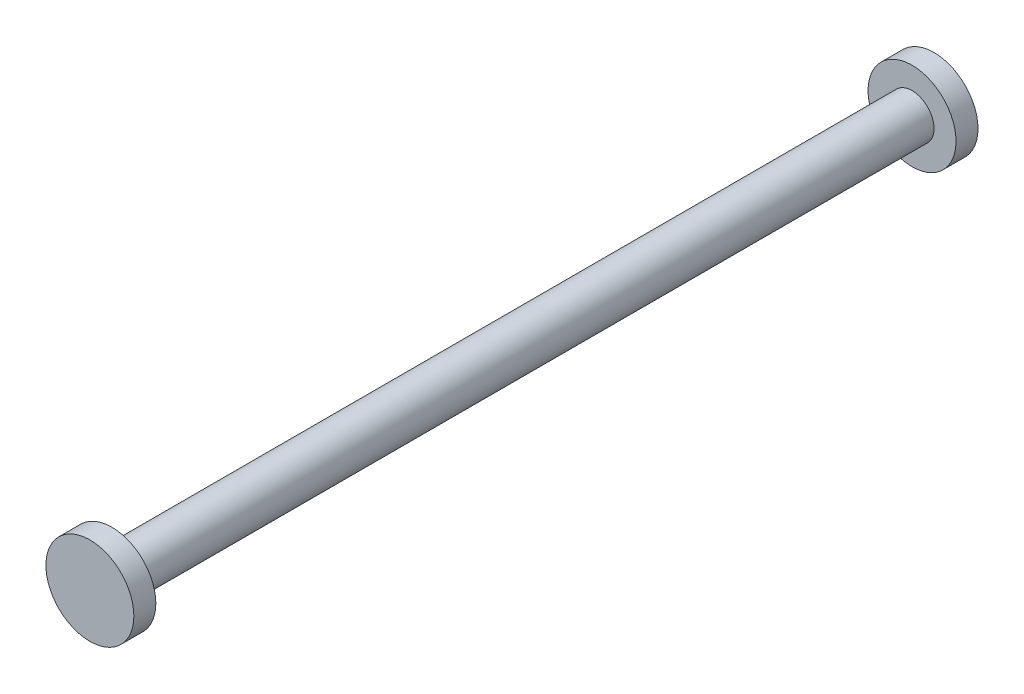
from build123d import *

# Parameters (mm, degrees)
SKETCH1_R           = 10
BOSS_EXTRUDE1_DEPTH = 5
SKETCH2_R           = 5
BOSS_EXTRUDE2_DEPTH = 182
SKETCH3_R           = 10
BOSS_EXTRUDE3_DEPTH = 5


with BuildPart() as part:
    # Sketch1 → Boss-Extrude1 (new body)
    with BuildSketch(Plane.XY):
        Circle(SKETCH1_R)
    extrude(amount=BOSS_EXTRUDE1_DEPTH)

    # Sketch2 → Boss-Extrude2 (add)
    with BuildSketch(Plane.XY.offset(5)):
        Circle(SKETCH2_R)
    extrude(amount=BOSS_EXTRUDE2_DEPTH)

    # Sketch3 → Boss-Extrude3 (add)
    with BuildSketch(Plane.XY.offset(187)):
        Circle(SKETCH3_R)
    extrude(amount=BOSS_EXTRUDE3_DEPTH)


solid = part.part
